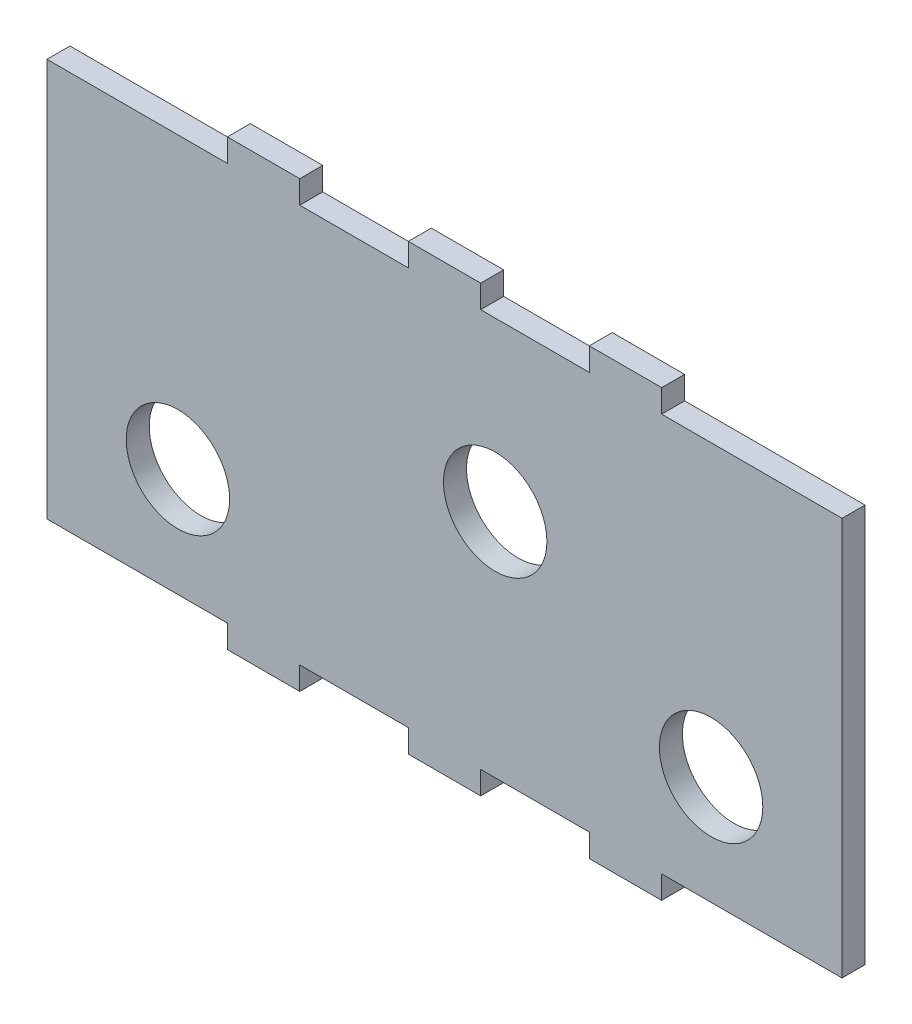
from build123d import *

# Parameters (mm, degrees)
SKETCH1_R           = 14.2875
BOSS_EXTRUDE1_DEPTH = 6.35


with BuildPart() as part:
    # Sketch1 → Boss-Extrude1 (new body)
    with BuildSketch(Plane.XY):
        Polygon((99.84, 0), (99.84, -6.35), (119.84, -6.35), (119.84, 0), (149.84, 0), (149.84, -6.35), (169.84, -6.35), (169.84, 0), (219.68, 0), (219.68, 110), (169.84, 110), (169.84, 116.35), (149.84, 116.35), (149.84, 110), (119.84, 110), (119.84, 116.35), (99.84, 116.35), (99.84, 110), (69.84, 110), (69.84, 116.35), (49.84, 116.35), (49.84, 110), (0, 110), (0, 0), (49.84, 0), (49.84, -6.35), (69.84, -6.35), (69.84, 0), align=None)
        with Locations((36.18, 30)):
            Circle(SKETCH1_R, mode=Mode.SUBTRACT)
        with Locations((183.5, 30)):
            Circle(SKETCH1_R, mode=Mode.SUBTRACT)
        with Locations((123.846374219, 63.670386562)):
            Circle(SKETCH1_R, mode=Mode.SUBTRACT)
    extrude(amount=BOSS_EXTRUDE1_DEPTH)


solid = part.part
